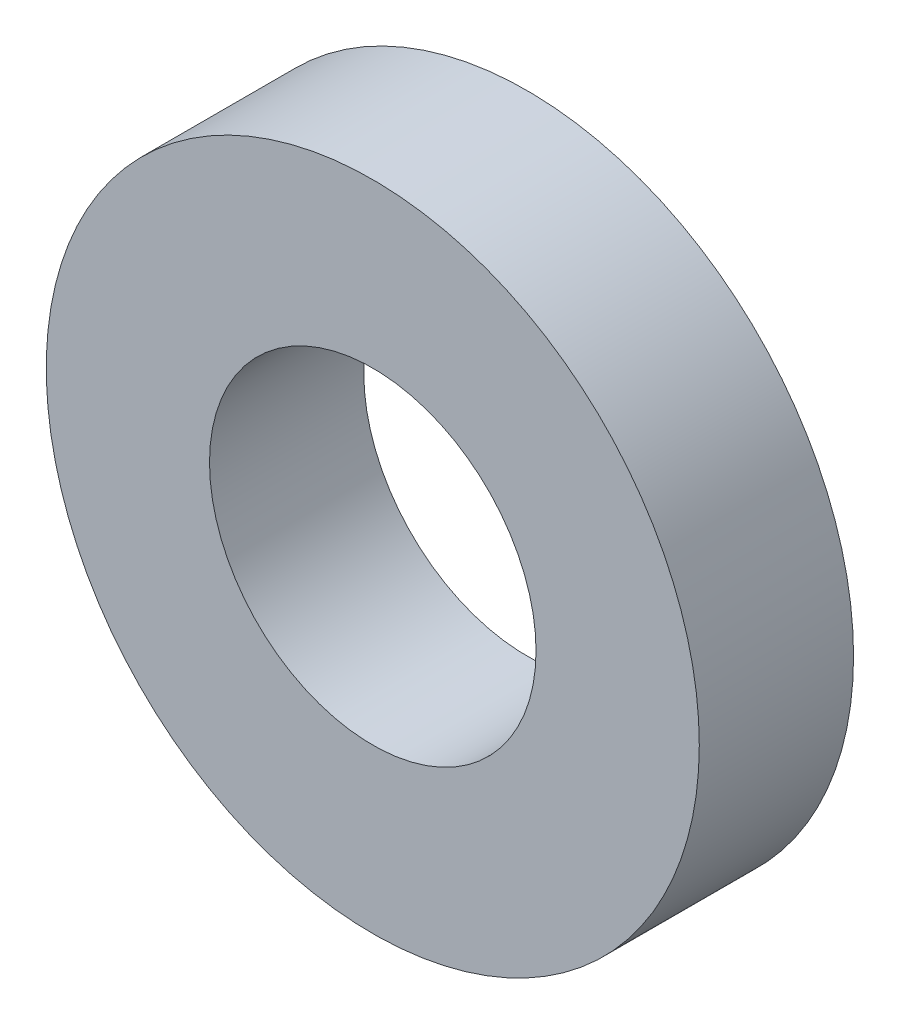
ISO-10303-21;
HEADER;
FILE_DESCRIPTION(('STEP AP214'),'2;1');
FILE_NAME('part.step','',(''),(''),'','','');
FILE_SCHEMA(('AUTOMOTIVE_DESIGN { 1 0 10303 214 1 1 1 1 }'));
ENDSEC;
DATA;
#1=APPLICATION_CONTEXT('core data for automotive mechanical design processes');
#2=APPLICATION_PROTOCOL_DEFINITION('international standard','automotive_design',2000,#1);
#3=PRODUCT_CONTEXT('',#1,'mechanical');
#4=PRODUCT('Part','Part','',(#3));
#5=PRODUCT_RELATED_PRODUCT_CATEGORY('part','',(#4));
#6=PRODUCT_DEFINITION_FORMATION('','',#4);
#7=PRODUCT_DEFINITION_CONTEXT('part definition',#1,'design');
#8=PRODUCT_DEFINITION('design','',#6,#7);
#9=PRODUCT_DEFINITION_SHAPE('','',#8);
#10=(LENGTH_UNIT() NAMED_UNIT(*) SI_UNIT(.MILLI.,.METRE.));
#11=(NAMED_UNIT(*) PLANE_ANGLE_UNIT() SI_UNIT($,.RADIAN.));
#12=(NAMED_UNIT(*) SI_UNIT($,.STERADIAN.) SOLID_ANGLE_UNIT());
#13=UNCERTAINTY_MEASURE_WITH_UNIT(LENGTH_MEASURE(1.E-05),#10,'distance_accuracy_value','');
#14=(GEOMETRIC_REPRESENTATION_CONTEXT(3) GLOBAL_UNCERTAINTY_ASSIGNED_CONTEXT((#13)) GLOBAL_UNIT_ASSIGNED_CONTEXT((#10,
#11,#12)) REPRESENTATION_CONTEXT('',''));
#15=CARTESIAN_POINT('',(0.,0.,0.));
#16=DIRECTION('',(0.,0.,1.));
#17=DIRECTION('',(1.,0.,0.));
#18=AXIS2_PLACEMENT_3D('',#15,#16,#17);
#19=CARTESIAN_POINT('',(0.,0.,3.));
#20=DIRECTION('',(0.,0.,1.));
#21=DIRECTION('',(1.,0.,0.));
#22=AXIS2_PLACEMENT_3D('',#19,#20,#21);
#23=PLANE('',#22);
#24=CARTESIAN_POINT('',(0.,0.,3.));
#25=DIRECTION('',(0.,0.,1.));
#26=DIRECTION('',(1.,0.,0.));
#27=AXIS2_PLACEMENT_3D('',#24,#25,#26);
#28=CIRCLE('',#27,6.35);
#29=CARTESIAN_POINT('',(6.35,0.,3.));
#30=VERTEX_POINT('',#29);
#31=EDGE_CURVE('E10',#30,#30,#28,.T.);
#32=ORIENTED_EDGE('',*,*,#31,.T.);
#33=EDGE_LOOP('',(#32));
#34=FACE_BOUND('',#33,.T.);
#35=CARTESIAN_POINT('',(0.,0.,3.));
#36=DIRECTION('',(0.,0.,1.));
#37=DIRECTION('',(1.,0.,0.));
#38=AXIS2_PLACEMENT_3D('',#35,#36,#37);
#39=CIRCLE('',#38,3.175);
#40=CARTESIAN_POINT('',(3.175,0.,3.));
#41=VERTEX_POINT('',#40);
#42=EDGE_CURVE('E52',#41,#41,#39,.T.);
#43=ORIENTED_EDGE('',*,*,#42,.F.);
#44=EDGE_LOOP('',(#43));
#45=FACE_BOUND('',#44,.T.);
#46=ADVANCED_FACE('F41',(#34,#45),#23,.T.);
#47=CARTESIAN_POINT('',(0.,0.,0.));
#48=DIRECTION('',(0.,0.,1.));
#49=DIRECTION('',(1.,0.,0.));
#50=AXIS2_PLACEMENT_3D('',#47,#48,#49);
#51=PLANE('',#50);
#52=CARTESIAN_POINT('',(0.,0.,0.));
#53=DIRECTION('',(0.,0.,1.));
#54=DIRECTION('',(1.,0.,0.));
#55=AXIS2_PLACEMENT_3D('',#52,#53,#54);
#56=CIRCLE('',#55,6.35);
#57=CARTESIAN_POINT('',(6.35,0.,0.));
#58=VERTEX_POINT('',#57);
#59=EDGE_CURVE('E45',#58,#58,#56,.T.);
#60=ORIENTED_EDGE('',*,*,#59,.F.);
#61=EDGE_LOOP('',(#60));
#62=FACE_BOUND('',#61,.T.);
#63=CARTESIAN_POINT('',(0.,0.,0.));
#64=DIRECTION('',(0.,0.,1.));
#65=DIRECTION('',(1.,0.,0.));
#66=AXIS2_PLACEMENT_3D('',#63,#64,#65);
#67=CIRCLE('',#66,3.175);
#68=CARTESIAN_POINT('',(3.175,0.,0.));
#69=VERTEX_POINT('',#68);
#70=EDGE_CURVE('E54',#69,#69,#67,.T.);
#71=ORIENTED_EDGE('',*,*,#70,.T.);
#72=EDGE_LOOP('',(#71));
#73=FACE_BOUND('',#72,.T.);
#74=ADVANCED_FACE('F64',(#62,#73),#51,.F.);
#75=CARTESIAN_POINT('',(0.,0.,3.));
#76=DIRECTION('',(0.,0.,-1.));
#77=DIRECTION('',(-1.,0.,0.));
#78=AXIS2_PLACEMENT_3D('',#75,#76,#77);
#79=CYLINDRICAL_SURFACE('',#78,6.35);
#80=ORIENTED_EDGE('',*,*,#31,.F.);
#81=EDGE_LOOP('',(#80));
#82=FACE_BOUND('',#81,.T.);
#83=ORIENTED_EDGE('',*,*,#59,.T.);
#84=EDGE_LOOP('',(#83));
#85=FACE_BOUND('',#84,.T.);
#86=ADVANCED_FACE('F43',(#82,#85),#79,.T.);
#87=CARTESIAN_POINT('',(0.,0.,3.));
#88=DIRECTION('',(0.,0.,-1.));
#89=DIRECTION('',(-1.,0.,0.));
#90=AXIS2_PLACEMENT_3D('',#87,#88,#89);
#91=CYLINDRICAL_SURFACE('',#90,3.175);
#92=ORIENTED_EDGE('',*,*,#42,.T.);
#93=EDGE_LOOP('',(#92));
#94=FACE_BOUND('',#93,.T.);
#95=ORIENTED_EDGE('',*,*,#70,.F.);
#96=EDGE_LOOP('',(#95));
#97=FACE_BOUND('',#96,.T.);
#98=ADVANCED_FACE('F60',(#94,#97),#91,.F.);
#99=CLOSED_SHELL('',(#46,#74,#86,#98));
#100=MANIFOLD_SOLID_BREP('B2',#99);
#101=ADVANCED_BREP_SHAPE_REPRESENTATION('',(#18,#100),#14);
#102=SHAPE_DEFINITION_REPRESENTATION(#9,#101);
ENDSEC;
END-ISO-10303-21;
